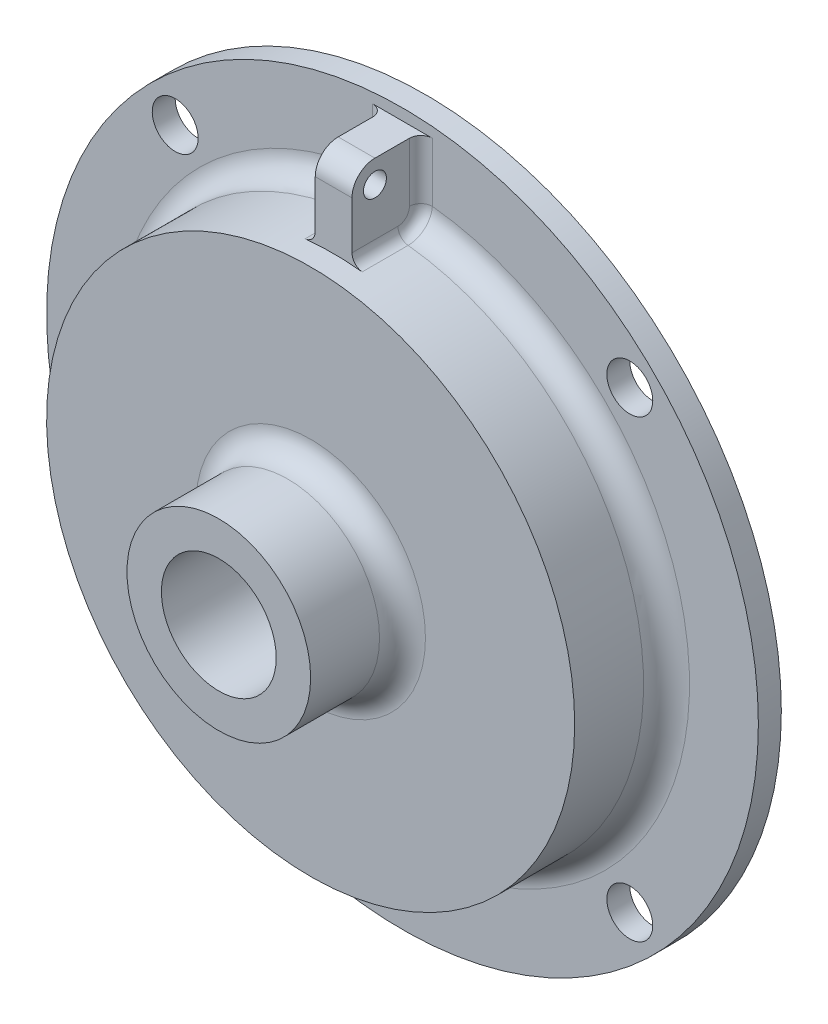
from build123d import *

# Parameters (mm, degrees)
SKETCH1_R           = 49.2125
BASE_EXTRUDE_DEPTH  = 3.175
SKETCH5_R           = 3.175
CUT_EXTRUDE2_DEPTH  = 70.669368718
CIRPATTERN1_COUNT   = 4
SKETCH2_R           = 36.5125
BOSS_EXTRUDE1_DEPTH = 12.7
SKETCH3_R           = 12.7
BOSS_EXTRUDE2_DEPTH = 12.7
FILLET1_R           = 3.175
SKETCH6_W           = 5.08
SKETCH6_H           = 9.525
BOSS_EXTRUDE3_DEPTH = 47.625
SKETCH4_R           = 7.9375
CUT_EXTRUDE1_DEPTH  = 76.23477213
FILLET2_R           = 3.175
CUT_EXTRUDE3_REACH  = 78.92
SKETCH7_R           = 1.5875
FILLET3_R           = 1.5875


with BuildPart() as part:
    # Sketch1 → Base-Extrude (new body)
    with BuildSketch(Plane.XY):
        Circle(SKETCH1_R)
    extrude(amount=BASE_EXTRUDE_DEPTH)

    # Sketch5 → Cut-Extrude2 (cut, through all)
    with BuildSketch(Plane.XY.offset(3.175)):
        with Locations((31.430896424, 31.430896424)):
            Circle(SKETCH5_R)
    cut_extrude2 = extrude(amount=-CUT_EXTRUDE2_DEPTH, mode=Mode.SUBTRACT)

    # CirPattern1: Cut-Extrude2 ×4 about axis
    cirpattern1_axis = Axis((0, 0, 0), (0, 0, 1))
    for i in range(1, CIRPATTERN1_COUNT):
        add(cut_extrude2.rotate(cirpattern1_axis, i * 360 / CIRPATTERN1_COUNT), mode=Mode.SUBTRACT)

    # Sketch2 → Boss-Extrude1 (add)
    with BuildSketch(Plane.XY.offset(3.175)):
        Circle(SKETCH2_R)
    extrude(amount=BOSS_EXTRUDE1_DEPTH)

    # Sketch3 → Boss-Extrude2 (add)
    with BuildSketch(Plane.XY.offset(15.875)):
        Circle(SKETCH3_R)
    extrude(amount=BOSS_EXTRUDE2_DEPTH)

    # Fillet1
    fillet1_edges = [part.edges().sort_by_distance(p)[0] for p in [
        (-36.5125, 0, 3.175),
        (-12.7, 0, 15.875),
    ]]
    fillet(fillet1_edges, radius=FILLET1_R)

    # Sketch6 → Boss-Extrude3 (add)
    with BuildSketch(Plane(origin=(0, 0, 0), x_dir=(1, 0, 0), z_dir=(0, 1, 0))):
        with Locations((0, -7.9375)):
            Rectangle(SKETCH6_W, SKETCH6_H)
    extrude(amount=BOSS_EXTRUDE3_DEPTH)

    # Sketch4 → Cut-Extrude1 (cut, through all)
    with BuildSketch(Plane.XY.offset(28.575)):
        Circle(SKETCH4_R)
    extrude(amount=-CUT_EXTRUDE1_DEPTH, mode=Mode.SUBTRACT)

    # Fillet2
    fillet2_edges = [part.edges().sort_by_distance(p)[0] for p in [
        (0, 47.625, 12.7),
    ]]
    fillet(fillet2_edges, radius=FILLET2_R)

    # Sketch7 → Cut-Extrude3 (cut, up to next)
    with BuildSketch(Plane(origin=(2.54, 0, 0), x_dir=(0, 0, -1), z_dir=(1, 0, 0)), mode=Mode.PRIVATE) as cut_extrude3_sk1:
        with Locations((-9.525, 44.45)):
            Circle(SKETCH7_R)
    cut_extrude3_tool1 = extrude(cut_extrude3_sk1.sketch, amount=-CUT_EXTRUDE3_REACH, mode=Mode.PRIVATE) & part.part
    add(cut_extrude3_tool1.solids().sort_by_distance((2.54, 44.45, 9.525))[0], mode=Mode.SUBTRACT)

    # Fillet3
    fillet3_edges = [part.edges().sort_by_distance(p)[0] for p in [
        (2.54, 43.615568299, 3.175),
        (-2.54, 36.424045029, 9.5249997),
        (-2.54, 43.615568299, 3.175),
        (2.54, 36.424045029, 9.5249997),
    ]]
    fillet(fillet3_edges, radius=FILLET3_R)


solid = part.part
